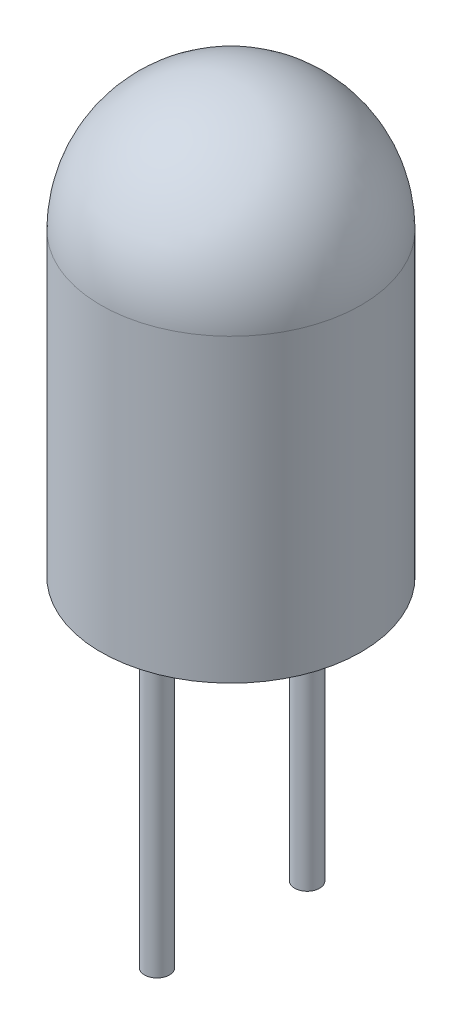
from build123d import *

# Parameters (mm, degrees)
ESQUISSE2_R      = 0.25
EXTRUSION1_DEPTH = 6


with BuildPart() as part:
    # Esquisse1 → R_volution1 (revolve)
    with BuildSketch(Plane.XY):
        with BuildLine():
            Line((0, -8.6), (2.6, -8.6))
            Line((2.6, -8.6), (2.6, -2.6))
            ThreePointArc((2.6, -2.6), (1.838477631, -0.761522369), (0, 0))
            Line((0, 0), (0, -8.6))
        make_face()
    revolve(axis=Axis((0, -39.914285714, 0), (0, 1, 0)))

    # Esquisse2 → Extrusion1 (add)
    with BuildSketch(Plane.XZ.offset(8.6)):
        with Locations(Location((0.022156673, 1.499836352, 0), (0, 0, 90))):
            Circle(ESQUISSE2_R)
        with Locations(Location((0.022156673, -1.499836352, 0), (0, 0, 90))):
            Circle(ESQUISSE2_R)
    extrude(amount=EXTRUSION1_DEPTH)


solid = part.part
